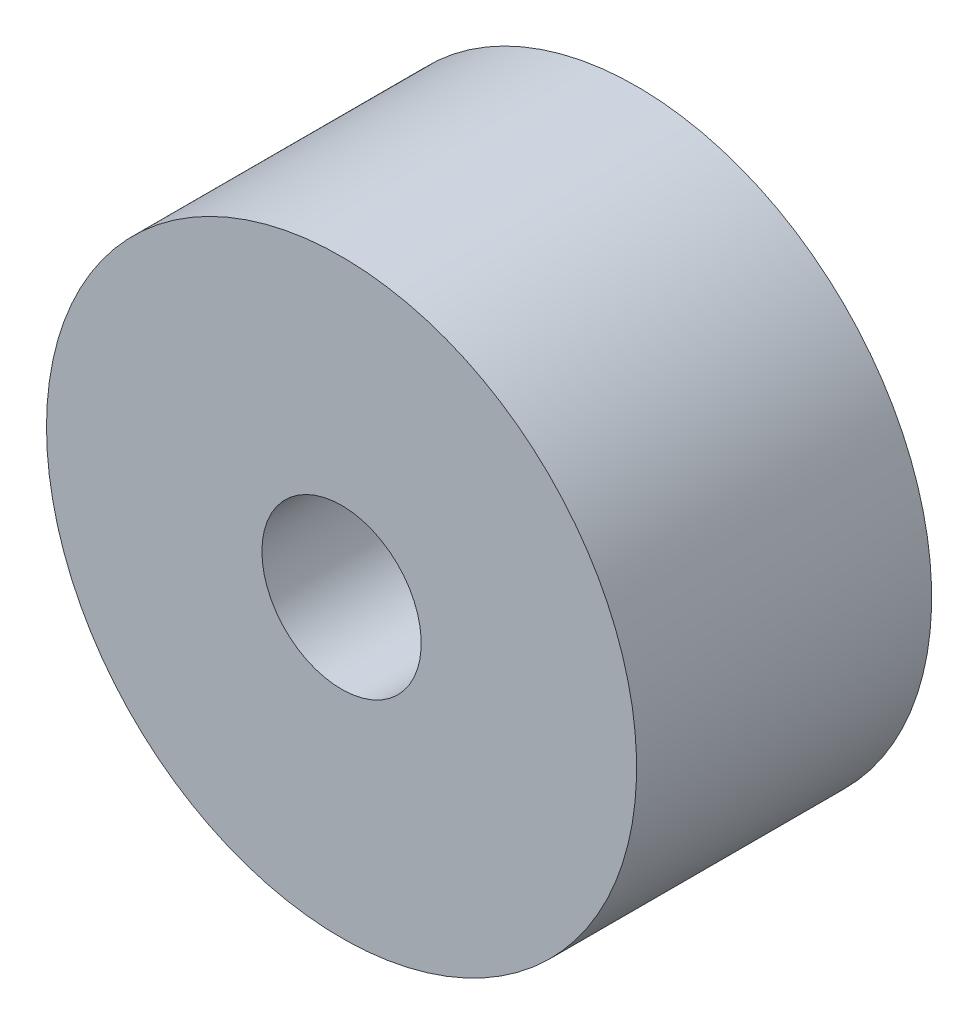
from build123d import *

# Parameters (mm, degrees)
SKETCH1_R           = 5
SKETCH1_R_2         = 1.35
BOSS_EXTRUDE1_DEPTH = 5


with BuildPart() as part:
    # Sketch1 → Boss-Extrude1 (new body)
    with BuildSketch(Plane(origin=(0, 0, -11.480220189), x_dir=(-1, 0, 0), z_dir=(0, 0, -1))):
        with Locations((-12.493055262, 19.519789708)):
            Circle(SKETCH1_R)
        with Locations((-12.493055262, 19.519789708)):
            Circle(SKETCH1_R_2, mode=Mode.SUBTRACT)
    extrude(amount=-BOSS_EXTRUDE1_DEPTH)


solid = part.part
